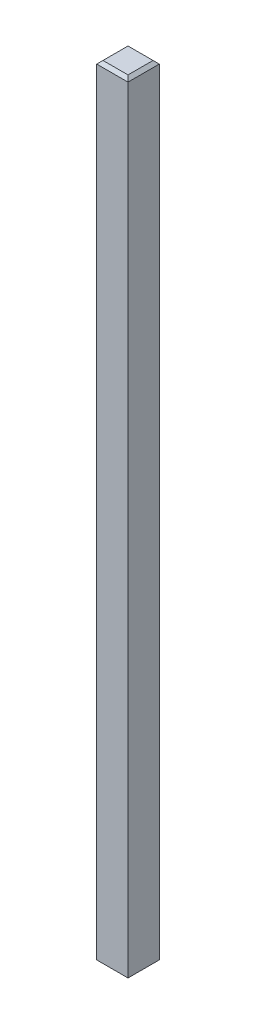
ISO-10303-21;
HEADER;
FILE_DESCRIPTION(('STEP AP214'),'2;1');
FILE_NAME('part.step','',(''),(''),'','','');
FILE_SCHEMA(('AUTOMOTIVE_DESIGN { 1 0 10303 214 1 1 1 1 }'));
ENDSEC;
DATA;
#1=APPLICATION_CONTEXT('core data for automotive mechanical design processes');
#2=APPLICATION_PROTOCOL_DEFINITION('international standard','automotive_design',2000,#1);
#3=PRODUCT_CONTEXT('',#1,'mechanical');
#4=PRODUCT('Part','Part','',(#3));
#5=PRODUCT_RELATED_PRODUCT_CATEGORY('part','',(#4));
#6=PRODUCT_DEFINITION_FORMATION('','',#4);
#7=PRODUCT_DEFINITION_CONTEXT('part definition',#1,'design');
#8=PRODUCT_DEFINITION('design','',#6,#7);
#9=PRODUCT_DEFINITION_SHAPE('','',#8);
#10=(LENGTH_UNIT() NAMED_UNIT(*) SI_UNIT(.MILLI.,.METRE.));
#11=(NAMED_UNIT(*) PLANE_ANGLE_UNIT() SI_UNIT($,.RADIAN.));
#12=(NAMED_UNIT(*) SI_UNIT($,.STERADIAN.) SOLID_ANGLE_UNIT());
#13=UNCERTAINTY_MEASURE_WITH_UNIT(LENGTH_MEASURE(1.E-05),#10,'distance_accuracy_value','');
#14=(GEOMETRIC_REPRESENTATION_CONTEXT(3) GLOBAL_UNCERTAINTY_ASSIGNED_CONTEXT((#13)) GLOBAL_UNIT_ASSIGNED_CONTEXT((#10,
#11,#12)) REPRESENTATION_CONTEXT('',''));
#15=CARTESIAN_POINT('',(0.,0.,0.));
#16=DIRECTION('',(0.,0.,1.));
#17=DIRECTION('',(1.,0.,0.));
#18=AXIS2_PLACEMENT_3D('',#15,#16,#17);
#19=CARTESIAN_POINT('',(0.,0.,10.));
#20=DIRECTION('',(1.,0.,0.));
#21=DIRECTION('',(0.,0.,-1.));
#22=AXIS2_PLACEMENT_3D('',#19,#20,#21);
#23=PLANE('',#22);
#24=DIRECTION('',(0.,-1.,0.));
#25=VECTOR('',#24,1.);
#26=CARTESIAN_POINT('',(0.,0.,10.));
#27=LINE('',#26,#25);
#28=CARTESIAN_POINT('',(0.,249.,10.));
#29=VERTEX_POINT('',#28);
#30=CARTESIAN_POINT('',(0.,0.999999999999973,10.));
#31=VERTEX_POINT('',#30);
#32=EDGE_CURVE('E210',#29,#31,#27,.T.);
#33=ORIENTED_EDGE('',*,*,#32,.F.);
#34=DIRECTION('',(0.,0.,-1.));
#35=VECTOR('',#34,1.);
#36=CARTESIAN_POINT('',(0.,249.,10.));
#37=LINE('',#36,#35);
#38=CARTESIAN_POINT('',(0.,249.,0.));
#39=VERTEX_POINT('',#38);
#40=EDGE_CURVE('E154',#29,#39,#37,.T.);
#41=ORIENTED_EDGE('',*,*,#40,.T.);
#42=DIRECTION('',(0.,-1.,0.));
#43=VECTOR('',#42,1.);
#44=CARTESIAN_POINT('',(0.,0.,0.));
#45=LINE('',#44,#43);
#46=CARTESIAN_POINT('',(0.,0.999999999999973,0.));
#47=VERTEX_POINT('',#46);
#48=EDGE_CURVE('E178',#39,#47,#45,.T.);
#49=ORIENTED_EDGE('',*,*,#48,.T.);
#50=DIRECTION('',(0.,0.,1.));
#51=VECTOR('',#50,1.);
#52=CARTESIAN_POINT('',(0.,0.999999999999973,10.));
#53=LINE('',#52,#51);
#54=EDGE_CURVE('E150',#47,#31,#53,.T.);
#55=ORIENTED_EDGE('',*,*,#54,.T.);
#56=EDGE_LOOP('',(#33,#41,#49,#55));
#57=FACE_BOUND('',#56,.T.);
#58=ADVANCED_FACE('F39',(#57),#23,.F.);
#59=CARTESIAN_POINT('',(0.,0.,10.));
#60=DIRECTION('',(0.,1.,0.));
#61=DIRECTION('',(0.,0.,1.));
#62=AXIS2_PLACEMENT_3D('',#59,#60,#61);
#63=PLANE('',#62);
#64=DIRECTION('',(-1.,0.,0.));
#65=VECTOR('',#64,1.);
#66=CARTESIAN_POINT('',(0.,0.,9.));
#67=LINE('',#66,#65);
#68=CARTESIAN_POINT('',(9.,0.,9.));
#69=VERTEX_POINT('',#68);
#70=CARTESIAN_POINT('',(1.,0.,9.));
#71=VERTEX_POINT('',#70);
#72=EDGE_CURVE('E49',#69,#71,#67,.T.);
#73=ORIENTED_EDGE('',*,*,#72,.T.);
#74=DIRECTION('',(0.,0.,-1.));
#75=VECTOR('',#74,1.);
#76=CARTESIAN_POINT('',(1.,0.,10.));
#77=LINE('',#76,#75);
#78=CARTESIAN_POINT('',(1.,0.,1.));
#79=VERTEX_POINT('',#78);
#80=EDGE_CURVE('E11',#71,#79,#77,.T.);
#81=ORIENTED_EDGE('',*,*,#80,.T.);
#82=DIRECTION('',(1.,0.,0.));
#83=VECTOR('',#82,1.);
#84=CARTESIAN_POINT('',(10.,0.,1.));
#85=LINE('',#84,#83);
#86=CARTESIAN_POINT('',(9.,0.,1.));
#87=VERTEX_POINT('',#86);
#88=EDGE_CURVE('E163',#79,#87,#85,.T.);
#89=ORIENTED_EDGE('',*,*,#88,.T.);
#90=DIRECTION('',(0.,0.,1.));
#91=VECTOR('',#90,1.);
#92=CARTESIAN_POINT('',(9.,0.,10.));
#93=LINE('',#92,#91);
#94=EDGE_CURVE('E60',#87,#69,#93,.T.);
#95=ORIENTED_EDGE('',*,*,#94,.T.);
#96=EDGE_LOOP('',(#73,#81,#89,#95));
#97=FACE_BOUND('',#96,.T.);
#98=ADVANCED_FACE('F237',(#97),#63,.F.);
#99=CARTESIAN_POINT('',(10.,0.,10.));
#100=DIRECTION('',(-1.,0.,0.));
#101=DIRECTION('',(0.,0.,1.));
#102=AXIS2_PLACEMENT_3D('',#99,#100,#101);
#103=PLANE('',#102);
#104=DIRECTION('',(0.,1.,0.));
#105=VECTOR('',#104,1.);
#106=CARTESIAN_POINT('',(10.,0.,0.));
#107=LINE('',#106,#105);
#108=CARTESIAN_POINT('',(10.,0.999999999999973,0.));
#109=VERTEX_POINT('',#108);
#110=CARTESIAN_POINT('',(10.,249.,0.));
#111=VERTEX_POINT('',#110);
#112=EDGE_CURVE('E203',#109,#111,#107,.T.);
#113=ORIENTED_EDGE('',*,*,#112,.T.);
#114=DIRECTION('',(0.,0.,1.));
#115=VECTOR('',#114,1.);
#116=CARTESIAN_POINT('',(10.,249.,10.));
#117=LINE('',#116,#115);
#118=CARTESIAN_POINT('',(10.,249.,10.));
#119=VERTEX_POINT('',#118);
#120=EDGE_CURVE('E112',#111,#119,#117,.T.);
#121=ORIENTED_EDGE('',*,*,#120,.T.);
#122=DIRECTION('',(0.,1.,0.));
#123=VECTOR('',#122,1.);
#124=CARTESIAN_POINT('',(10.,0.,10.));
#125=LINE('',#124,#123);
#126=CARTESIAN_POINT('',(10.,0.999999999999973,10.));
#127=VERTEX_POINT('',#126);
#128=EDGE_CURVE('E127',#127,#119,#125,.T.);
#129=ORIENTED_EDGE('',*,*,#128,.F.);
#130=DIRECTION('',(0.,0.,-1.));
#131=VECTOR('',#130,1.);
#132=CARTESIAN_POINT('',(10.,0.999999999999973,10.));
#133=LINE('',#132,#131);
#134=EDGE_CURVE('E134',#127,#109,#133,.T.);
#135=ORIENTED_EDGE('',*,*,#134,.T.);
#136=EDGE_LOOP('',(#113,#121,#129,#135));
#137=FACE_BOUND('',#136,.T.);
#138=ADVANCED_FACE('F202',(#137),#103,.F.);
#139=CARTESIAN_POINT('',(0.,250.,10.));
#140=DIRECTION('',(0.,-1.,0.));
#141=DIRECTION('',(0.,0.,-1.));
#142=AXIS2_PLACEMENT_3D('',#139,#140,#141);
#143=PLANE('',#142);
#144=DIRECTION('',(1.,0.,0.));
#145=VECTOR('',#144,1.);
#146=CARTESIAN_POINT('',(0.,250.,9.));
#147=LINE('',#146,#145);
#148=CARTESIAN_POINT('',(1.,250.,9.));
#149=VERTEX_POINT('',#148);
#150=CARTESIAN_POINT('',(9.,250.,9.));
#151=VERTEX_POINT('',#150);
#152=EDGE_CURVE('E131',#149,#151,#147,.T.);
#153=ORIENTED_EDGE('',*,*,#152,.T.);
#154=DIRECTION('',(0.,0.,-1.));
#155=VECTOR('',#154,1.);
#156=CARTESIAN_POINT('',(9.,250.,10.));
#157=LINE('',#156,#155);
#158=CARTESIAN_POINT('',(9.,250.,1.));
#159=VERTEX_POINT('',#158);
#160=EDGE_CURVE('E110',#151,#159,#157,.T.);
#161=ORIENTED_EDGE('',*,*,#160,.T.);
#162=DIRECTION('',(-1.,0.,0.));
#163=VECTOR('',#162,1.);
#164=CARTESIAN_POINT('',(0.,250.,1.));
#165=LINE('',#164,#163);
#166=CARTESIAN_POINT('',(1.,250.,1.));
#167=VERTEX_POINT('',#166);
#168=EDGE_CURVE('E119',#159,#167,#165,.T.);
#169=ORIENTED_EDGE('',*,*,#168,.T.);
#170=DIRECTION('',(0.,0.,1.));
#171=VECTOR('',#170,1.);
#172=CARTESIAN_POINT('',(1.,250.,10.));
#173=LINE('',#172,#171);
#174=EDGE_CURVE('E126',#167,#149,#173,.T.);
#175=ORIENTED_EDGE('',*,*,#174,.T.);
#176=EDGE_LOOP('',(#153,#161,#169,#175));
#177=FACE_BOUND('',#176,.T.);
#178=ADVANCED_FACE('F129',(#177),#143,.F.);
#179=CARTESIAN_POINT('',(0.,0.,10.));
#180=DIRECTION('',(0.,0.,-1.));
#181=DIRECTION('',(-1.,0.,0.));
#182=AXIS2_PLACEMENT_3D('',#179,#180,#181);
#183=PLANE('',#182);
#184=ORIENTED_EDGE('',*,*,#128,.T.);
#185=DIRECTION('',(-1.,0.,0.));
#186=VECTOR('',#185,1.);
#187=CARTESIAN_POINT('',(0.,249.,10.));
#188=LINE('',#187,#186);
#189=EDGE_CURVE('E147',#119,#29,#188,.T.);
#190=ORIENTED_EDGE('',*,*,#189,.T.);
#191=ORIENTED_EDGE('',*,*,#32,.T.);
#192=DIRECTION('',(1.,0.,0.));
#193=VECTOR('',#192,1.);
#194=CARTESIAN_POINT('',(0.,0.999999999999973,10.));
#195=LINE('',#194,#193);
#196=EDGE_CURVE('E144',#31,#127,#195,.T.);
#197=ORIENTED_EDGE('',*,*,#196,.T.);
#198=EDGE_LOOP('',(#184,#190,#191,#197));
#199=FACE_BOUND('',#198,.T.);
#200=ADVANCED_FACE('F228',(#199),#183,.F.);
#201=CARTESIAN_POINT('',(0.,0.,0.));
#202=DIRECTION('',(0.,0.,-1.));
#203=DIRECTION('',(-1.,0.,0.));
#204=AXIS2_PLACEMENT_3D('',#201,#202,#203);
#205=PLANE('',#204);
#206=ORIENTED_EDGE('',*,*,#48,.F.);
#207=DIRECTION('',(1.,0.,0.));
#208=VECTOR('',#207,1.);
#209=CARTESIAN_POINT('',(10.,249.,0.));
#210=LINE('',#209,#208);
#211=EDGE_CURVE('E160',#39,#111,#210,.T.);
#212=ORIENTED_EDGE('',*,*,#211,.T.);
#213=ORIENTED_EDGE('',*,*,#112,.F.);
#214=DIRECTION('',(-1.,0.,0.));
#215=VECTOR('',#214,1.);
#216=CARTESIAN_POINT('',(0.,0.999999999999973,0.));
#217=LINE('',#216,#215);
#218=EDGE_CURVE('E157',#109,#47,#217,.T.);
#219=ORIENTED_EDGE('',*,*,#218,.T.);
#220=EDGE_LOOP('',(#206,#212,#213,#219));
#221=FACE_BOUND('',#220,.T.);
#222=ADVANCED_FACE('F207',(#221),#205,.T.);
#223=CARTESIAN_POINT('',(0.,249.,10.));
#224=DIRECTION('',(0.707106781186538,-0.707106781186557,0.));
#225=DIRECTION('',(0.,0.,-1.));
#226=AXIS2_PLACEMENT_3D('',#223,#224,#225);
#227=PLANE('',#226);
#228=DIRECTION('',(-0.577350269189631,-0.577350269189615,-0.577350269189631));
#229=VECTOR('',#228,1.);
#230=CARTESIAN_POINT('',(0.666666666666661,249.666666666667,0.666666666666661));
#231=LINE('',#230,#229);
#232=EDGE_CURVE('E122',#39,#167,#231,.F.);
#233=ORIENTED_EDGE('',*,*,#232,.F.);
#234=ORIENTED_EDGE('',*,*,#40,.F.);
#235=DIRECTION('',(0.577350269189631,0.577350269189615,-0.577350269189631));
#236=VECTOR('',#235,1.);
#237=CARTESIAN_POINT('',(0.,249.,10.));
#238=LINE('',#237,#236);
#239=EDGE_CURVE('E174',#149,#29,#238,.F.);
#240=ORIENTED_EDGE('',*,*,#239,.F.);
#241=ORIENTED_EDGE('',*,*,#174,.F.);
#242=EDGE_LOOP('',(#233,#234,#240,#241));
#243=FACE_BOUND('',#242,.T.);
#244=ADVANCED_FACE('F222',(#243),#227,.F.);
#245=CARTESIAN_POINT('',(0.,249.,10.));
#246=DIRECTION('',(0.,-0.707106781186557,-0.707106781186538));
#247=DIRECTION('',(-1.,0.,0.));
#248=AXIS2_PLACEMENT_3D('',#245,#246,#247);
#249=PLANE('',#248);
#250=ORIENTED_EDGE('',*,*,#239,.T.);
#251=ORIENTED_EDGE('',*,*,#189,.F.);
#252=DIRECTION('',(-0.577350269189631,0.577350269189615,-0.577350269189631));
#253=VECTOR('',#252,1.);
#254=CARTESIAN_POINT('',(6.66666666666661,252.333333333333,6.6666666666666));
#255=LINE('',#254,#253);
#256=EDGE_CURVE('E116',#151,#119,#255,.F.);
#257=ORIENTED_EDGE('',*,*,#256,.F.);
#258=ORIENTED_EDGE('',*,*,#152,.F.);
#259=EDGE_LOOP('',(#250,#251,#257,#258));
#260=FACE_BOUND('',#259,.T.);
#261=ADVANCED_FACE('F225',(#260),#249,.F.);
#262=CARTESIAN_POINT('',(0.,250.,1.));
#263=DIRECTION('',(0.,0.707106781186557,-0.707106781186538));
#264=DIRECTION('',(1.,0.,0.));
#265=AXIS2_PLACEMENT_3D('',#262,#263,#264);
#266=PLANE('',#265);
#267=ORIENTED_EDGE('',*,*,#232,.T.);
#268=ORIENTED_EDGE('',*,*,#168,.F.);
#269=DIRECTION('',(-0.577350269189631,0.577350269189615,0.577350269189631));
#270=VECTOR('',#269,1.);
#271=CARTESIAN_POINT('',(5.99999999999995,253.,4.00000000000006));
#272=LINE('',#271,#270);
#273=EDGE_CURVE('E106',#111,#159,#272,.T.);
#274=ORIENTED_EDGE('',*,*,#273,.F.);
#275=ORIENTED_EDGE('',*,*,#211,.F.);
#276=EDGE_LOOP('',(#267,#268,#274,#275));
#277=FACE_BOUND('',#276,.T.);
#278=ADVANCED_FACE('F120',(#277),#266,.T.);
#279=CARTESIAN_POINT('',(9.,250.,10.));
#280=DIRECTION('',(-0.707106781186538,-0.707106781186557,0.));
#281=DIRECTION('',(0.,0.,-1.));
#282=AXIS2_PLACEMENT_3D('',#279,#280,#281);
#283=PLANE('',#282);
#284=ORIENTED_EDGE('',*,*,#256,.T.);
#285=ORIENTED_EDGE('',*,*,#120,.F.);
#286=ORIENTED_EDGE('',*,*,#273,.T.);
#287=ORIENTED_EDGE('',*,*,#160,.F.);
#288=EDGE_LOOP('',(#284,#285,#286,#287));
#289=FACE_BOUND('',#288,.T.);
#290=ADVANCED_FACE('F108',(#289),#283,.F.);
#291=CARTESIAN_POINT('',(10.,0.999999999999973,10.));
#292=DIRECTION('',(-0.707106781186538,0.707106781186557,0.));
#293=DIRECTION('',(0.,0.,-1.));
#294=AXIS2_PLACEMENT_3D('',#291,#292,#293);
#295=PLANE('',#294);
#296=DIRECTION('',(0.577350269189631,0.577350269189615,-0.577350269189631));
#297=VECTOR('',#296,1.);
#298=CARTESIAN_POINT('',(5.99999999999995,-2.99999999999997,4.00000000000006));
#299=LINE('',#298,#297);
#300=EDGE_CURVE('E184',#109,#87,#299,.F.);
#301=ORIENTED_EDGE('',*,*,#300,.F.);
#302=ORIENTED_EDGE('',*,*,#134,.F.);
#303=DIRECTION('',(-0.577350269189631,-0.577350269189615,-0.577350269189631));
#304=VECTOR('',#303,1.);
#305=CARTESIAN_POINT('',(10.,0.999999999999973,10.));
#306=LINE('',#305,#304);
#307=EDGE_CURVE('E43',#69,#127,#306,.F.);
#308=ORIENTED_EDGE('',*,*,#307,.F.);
#309=ORIENTED_EDGE('',*,*,#94,.F.);
#310=EDGE_LOOP('',(#301,#302,#308,#309));
#311=FACE_BOUND('',#310,.T.);
#312=ADVANCED_FACE('F41',(#311),#295,.F.);
#313=CARTESIAN_POINT('',(0.,0.999999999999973,10.));
#314=DIRECTION('',(0.,0.707106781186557,-0.707106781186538));
#315=DIRECTION('',(1.,0.,0.));
#316=AXIS2_PLACEMENT_3D('',#313,#314,#315);
#317=PLANE('',#316);
#318=ORIENTED_EDGE('',*,*,#307,.T.);
#319=ORIENTED_EDGE('',*,*,#196,.F.);
#320=DIRECTION('',(0.577350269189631,-0.577350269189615,-0.577350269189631));
#321=VECTOR('',#320,1.);
#322=CARTESIAN_POINT('',(0.,0.999999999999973,10.));
#323=LINE('',#322,#321);
#324=EDGE_CURVE('E182',#71,#31,#323,.F.);
#325=ORIENTED_EDGE('',*,*,#324,.F.);
#326=ORIENTED_EDGE('',*,*,#72,.F.);
#327=EDGE_LOOP('',(#318,#319,#325,#326));
#328=FACE_BOUND('',#327,.T.);
#329=ADVANCED_FACE('F195',(#328),#317,.F.);
#330=CARTESIAN_POINT('',(0.,0.,1.));
#331=DIRECTION('',(0.,-0.707106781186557,-0.707106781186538));
#332=DIRECTION('',(-1.,0.,0.));
#333=AXIS2_PLACEMENT_3D('',#330,#331,#332);
#334=PLANE('',#333);
#335=ORIENTED_EDGE('',*,*,#300,.T.);
#336=ORIENTED_EDGE('',*,*,#88,.F.);
#337=DIRECTION('',(0.577350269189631,-0.577350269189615,0.577350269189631));
#338=VECTOR('',#337,1.);
#339=CARTESIAN_POINT('',(0.666666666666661,0.333333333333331,0.666666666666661));
#340=LINE('',#339,#338);
#341=EDGE_CURVE('E179',#47,#79,#340,.T.);
#342=ORIENTED_EDGE('',*,*,#341,.F.);
#343=ORIENTED_EDGE('',*,*,#218,.F.);
#344=EDGE_LOOP('',(#335,#336,#342,#343));
#345=FACE_BOUND('',#344,.T.);
#346=ADVANCED_FACE('F236',(#345),#334,.T.);
#347=CARTESIAN_POINT('',(1.,0.,10.));
#348=DIRECTION('',(0.707106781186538,0.707106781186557,0.));
#349=DIRECTION('',(0.,0.,-1.));
#350=AXIS2_PLACEMENT_3D('',#347,#348,#349);
#351=PLANE('',#350);
#352=ORIENTED_EDGE('',*,*,#324,.T.);
#353=ORIENTED_EDGE('',*,*,#54,.F.);
#354=ORIENTED_EDGE('',*,*,#341,.T.);
#355=ORIENTED_EDGE('',*,*,#80,.F.);
#356=EDGE_LOOP('',(#352,#353,#354,#355));
#357=FACE_BOUND('',#356,.T.);
#358=ADVANCED_FACE('F234',(#357),#351,.F.);
#359=CLOSED_SHELL('',(#58,#98,#138,#178,#200,#222,#244,#261,#278,#290,#312,#329,#346,#358));
#360=MANIFOLD_SOLID_BREP('B2',#359);
#361=ADVANCED_BREP_SHAPE_REPRESENTATION('',(#18,#360),#14);
#362=SHAPE_DEFINITION_REPRESENTATION(#9,#361);
ENDSEC;
END-ISO-10303-21;
